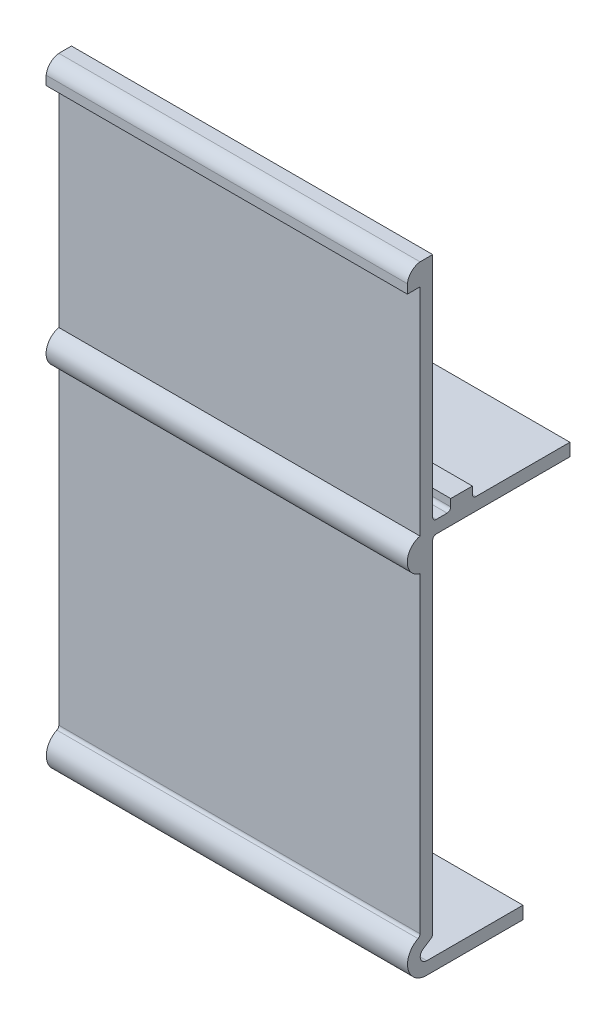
ISO-10303-21;
HEADER;
FILE_DESCRIPTION(('STEP AP214'),'2;1');
FILE_NAME('part.step','',(''),(''),'','','');
FILE_SCHEMA(('AUTOMOTIVE_DESIGN { 1 0 10303 214 1 1 1 1 }'));
ENDSEC;
DATA;
#1=APPLICATION_CONTEXT('core data for automotive mechanical design processes');
#2=APPLICATION_PROTOCOL_DEFINITION('international standard','automotive_design',2000,#1);
#3=PRODUCT_CONTEXT('',#1,'mechanical');
#4=PRODUCT('Part','Part','',(#3));
#5=PRODUCT_RELATED_PRODUCT_CATEGORY('part','',(#4));
#6=PRODUCT_DEFINITION_FORMATION('','',#4);
#7=PRODUCT_DEFINITION_CONTEXT('part definition',#1,'design');
#8=PRODUCT_DEFINITION('design','',#6,#7);
#9=PRODUCT_DEFINITION_SHAPE('','',#8);
#10=(LENGTH_UNIT() NAMED_UNIT(*) SI_UNIT(.MILLI.,.METRE.));
#11=(NAMED_UNIT(*) PLANE_ANGLE_UNIT() SI_UNIT($,.RADIAN.));
#12=(NAMED_UNIT(*) SI_UNIT($,.STERADIAN.) SOLID_ANGLE_UNIT());
#13=UNCERTAINTY_MEASURE_WITH_UNIT(LENGTH_MEASURE(1.E-05),#10,'distance_accuracy_value','');
#14=(GEOMETRIC_REPRESENTATION_CONTEXT(3) GLOBAL_UNCERTAINTY_ASSIGNED_CONTEXT((#13)) GLOBAL_UNIT_ASSIGNED_CONTEXT((#10,
#11,#12)) REPRESENTATION_CONTEXT('',''));
#15=CARTESIAN_POINT('',(0.,0.,0.));
#16=DIRECTION('',(0.,0.,1.));
#17=DIRECTION('',(1.,0.,0.));
#18=AXIS2_PLACEMENT_3D('',#15,#16,#17);
#19=CARTESIAN_POINT('',(-50.,104.500000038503,-39.6785715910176));
#20=DIRECTION('',(0.,0.,-1.));
#21=DIRECTION('',(-1.,0.,0.));
#22=AXIS2_PLACEMENT_3D('',#19,#20,#21);
#23=PLANE('',#22);
#24=DIRECTION('',(0.,1.,0.));
#25=VECTOR('',#24,1.);
#26=CARTESIAN_POINT('',(50.,104.500000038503,-39.6785715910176));
#27=LINE('',#26,#25);
#28=CARTESIAN_POINT('',(50.,104.500000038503,-39.6785715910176));
#29=VERTEX_POINT('',#28);
#30=CARTESIAN_POINT('',(50.,107.999999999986,-39.6785715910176));
#31=VERTEX_POINT('',#30);
#32=EDGE_CURVE('E251',#29,#31,#27,.T.);
#33=ORIENTED_EDGE('',*,*,#32,.F.);
#34=DIRECTION('',(1.,0.,0.));
#35=VECTOR('',#34,1.);
#36=CARTESIAN_POINT('',(-50.,104.500000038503,-39.6785715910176));
#37=LINE('',#36,#35);
#38=CARTESIAN_POINT('',(-50.,104.500000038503,-39.6785715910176));
#39=VERTEX_POINT('',#38);
#40=EDGE_CURVE('E11',#39,#29,#37,.T.);
#41=ORIENTED_EDGE('',*,*,#40,.F.);
#42=DIRECTION('',(0.,1.,0.));
#43=VECTOR('',#42,1.);
#44=CARTESIAN_POINT('',(-50.,104.500000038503,-39.6785715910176));
#45=LINE('',#44,#43);
#46=CARTESIAN_POINT('',(-50.,107.999999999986,-39.6785715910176));
#47=VERTEX_POINT('',#46);
#48=EDGE_CURVE('E331',#39,#47,#45,.T.);
#49=ORIENTED_EDGE('',*,*,#48,.T.);
#50=DIRECTION('',(1.,0.,0.));
#51=VECTOR('',#50,1.);
#52=CARTESIAN_POINT('',(-50.,107.999999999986,-39.6785715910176));
#53=LINE('',#52,#51);
#54=EDGE_CURVE('E37',#47,#31,#53,.T.);
#55=ORIENTED_EDGE('',*,*,#54,.T.);
#56=EDGE_LOOP('',(#33,#41,#49,#55));
#57=FACE_BOUND('',#56,.T.);
#58=ADVANCED_FACE('F34',(#57),#23,.T.);
#59=CARTESIAN_POINT('',(-50.,104.500000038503,-2.6785715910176));
#60=DIRECTION('',(0.,-1.,0.));
#61=DIRECTION('',(0.,0.,-1.));
#62=AXIS2_PLACEMENT_3D('',#59,#60,#61);
#63=PLANE('',#62);
#64=DIRECTION('',(0.,0.,-1.));
#65=VECTOR('',#64,1.);
#66=CARTESIAN_POINT('',(50.,104.500000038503,-2.6785715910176));
#67=LINE('',#66,#65);
#68=CARTESIAN_POINT('',(50.,104.500000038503,-2.6785715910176));
#69=VERTEX_POINT('',#68);
#70=EDGE_CURVE('E329',#69,#29,#67,.T.);
#71=ORIENTED_EDGE('',*,*,#70,.F.);
#72=DIRECTION('',(1.,0.,0.));
#73=VECTOR('',#72,1.);
#74=CARTESIAN_POINT('',(-50.,104.500000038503,-2.6785715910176));
#75=LINE('',#74,#73);
#76=CARTESIAN_POINT('',(-50.,104.500000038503,-2.6785715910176));
#77=VERTEX_POINT('',#76);
#78=EDGE_CURVE('E43',#77,#69,#75,.T.);
#79=ORIENTED_EDGE('',*,*,#78,.F.);
#80=DIRECTION('',(0.,0.,-1.));
#81=VECTOR('',#80,1.);
#82=CARTESIAN_POINT('',(-50.,104.500000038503,-2.6785715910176));
#83=LINE('',#82,#81);
#84=EDGE_CURVE('E241',#77,#39,#83,.T.);
#85=ORIENTED_EDGE('',*,*,#84,.T.);
#86=ORIENTED_EDGE('',*,*,#40,.T.);
#87=EDGE_LOOP('',(#71,#79,#85,#86));
#88=FACE_BOUND('',#87,.T.);
#89=ADVANCED_FACE('F383',(#88),#63,.T.);
#90=CARTESIAN_POINT('',(-50.,103.500000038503,-2.6785715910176));
#91=DIRECTION('',(1.,0.,0.));
#92=DIRECTION('',(0.,0.,-1.));
#93=AXIS2_PLACEMENT_3D('',#90,#91,#92);
#94=CYLINDRICAL_SURFACE('',#93,1.);
#95=CARTESIAN_POINT('',(50.,103.500000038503,-2.6785715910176));
#96=DIRECTION('',(-1.,0.,0.));
#97=DIRECTION('',(0.,0.,-1.));
#98=AXIS2_PLACEMENT_3D('',#95,#96,#97);
#99=CIRCLE('',#98,1.);
#100=CARTESIAN_POINT('',(50.,103.500000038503,-1.6785715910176));
#101=VERTEX_POINT('',#100);
#102=EDGE_CURVE('E228',#101,#69,#99,.T.);
#103=ORIENTED_EDGE('',*,*,#102,.F.);
#104=DIRECTION('',(1.,0.,0.));
#105=VECTOR('',#104,1.);
#106=CARTESIAN_POINT('',(-50.,103.500000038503,-1.6785715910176));
#107=LINE('',#106,#105);
#108=CARTESIAN_POINT('',(-50.,103.500000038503,-1.6785715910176));
#109=VERTEX_POINT('',#108);
#110=EDGE_CURVE('E223',#109,#101,#107,.T.);
#111=ORIENTED_EDGE('',*,*,#110,.F.);
#112=CARTESIAN_POINT('',(-50.,103.500000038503,-2.6785715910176));
#113=DIRECTION('',(-1.,0.,0.));
#114=DIRECTION('',(0.,0.,-1.));
#115=AXIS2_PLACEMENT_3D('',#112,#113,#114);
#116=CIRCLE('',#115,1.);
#117=EDGE_CURVE('E226',#109,#77,#116,.T.);
#118=ORIENTED_EDGE('',*,*,#117,.T.);
#119=ORIENTED_EDGE('',*,*,#78,.T.);
#120=EDGE_LOOP('',(#103,#111,#118,#119));
#121=FACE_BOUND('',#120,.T.);
#122=ADVANCED_FACE('F225',(#121),#94,.F.);
#123=CARTESIAN_POINT('',(-50.,103.500000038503,-1.6785715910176));
#124=DIRECTION('',(0.,0.,-1.));
#125=DIRECTION('',(-1.,0.,0.));
#126=AXIS2_PLACEMENT_3D('',#123,#124,#125);
#127=PLANE('',#126);
#128=DIRECTION('',(0.,1.,0.));
#129=VECTOR('',#128,1.);
#130=CARTESIAN_POINT('',(50.,103.500000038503,-1.6785715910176));
#131=LINE('',#130,#129);
#132=CARTESIAN_POINT('',(50.,9.07911749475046,-1.6785715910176));
#133=VERTEX_POINT('',#132);
#134=EDGE_CURVE('E326',#133,#101,#131,.T.);
#135=ORIENTED_EDGE('',*,*,#134,.F.);
#136=DIRECTION('',(1.,0.,0.));
#137=VECTOR('',#136,1.);
#138=CARTESIAN_POINT('',(-50.,9.07911749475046,-1.6785715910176));
#139=LINE('',#138,#137);
#140=CARTESIAN_POINT('',(-50.,9.07911749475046,-1.6785715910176));
#141=VERTEX_POINT('',#140);
#142=EDGE_CURVE('E233',#141,#133,#139,.T.);
#143=ORIENTED_EDGE('',*,*,#142,.F.);
#144=DIRECTION('',(0.,1.,0.));
#145=VECTOR('',#144,1.);
#146=CARTESIAN_POINT('',(-50.,103.500000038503,-1.6785715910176));
#147=LINE('',#146,#145);
#148=EDGE_CURVE('E239',#141,#109,#147,.T.);
#149=ORIENTED_EDGE('',*,*,#148,.T.);
#150=ORIENTED_EDGE('',*,*,#110,.T.);
#151=EDGE_LOOP('',(#135,#143,#149,#150));
#152=FACE_BOUND('',#151,.T.);
#153=ADVANCED_FACE('F243',(#152),#127,.T.);
#154=CARTESIAN_POINT('',(-50.,9.07911749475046,-0.67857159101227));
#155=DIRECTION('',(1.,0.,0.));
#156=DIRECTION('',(0.,0.,-1.));
#157=AXIS2_PLACEMENT_3D('',#154,#155,#156);
#158=CYLINDRICAL_SURFACE('',#157,1.00000000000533);
#159=CARTESIAN_POINT('',(50.,9.07911749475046,-0.67857159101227));
#160=DIRECTION('',(1.,0.,0.));
#161=DIRECTION('',(0.,0.,-1.));
#162=AXIS2_PLACEMENT_3D('',#159,#160,#161);
#163=CIRCLE('',#162,1.00000000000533);
#164=CARTESIAN_POINT('',(50.,8.23877684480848,-1.2206302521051));
#165=VERTEX_POINT('',#164);
#166=EDGE_CURVE('E323',#165,#133,#163,.T.);
#167=ORIENTED_EDGE('',*,*,#166,.F.);
#168=DIRECTION('',(1.,0.,0.));
#169=VECTOR('',#168,1.);
#170=CARTESIAN_POINT('',(-50.,8.23877684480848,-1.2206302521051));
#171=LINE('',#170,#169);
#172=CARTESIAN_POINT('',(-50.,8.23877684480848,-1.2206302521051));
#173=VERTEX_POINT('',#172);
#174=EDGE_CURVE('E335',#173,#165,#171,.T.);
#175=ORIENTED_EDGE('',*,*,#174,.F.);
#176=CARTESIAN_POINT('',(-50.,9.07911749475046,-0.67857159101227));
#177=DIRECTION('',(1.,0.,0.));
#178=DIRECTION('',(0.,0.,-1.));
#179=AXIS2_PLACEMENT_3D('',#176,#177,#178);
#180=CIRCLE('',#179,1.00000000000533);
#181=EDGE_CURVE('E244',#173,#141,#180,.T.);
#182=ORIENTED_EDGE('',*,*,#181,.T.);
#183=ORIENTED_EDGE('',*,*,#142,.T.);
#184=EDGE_LOOP('',(#167,#175,#182,#183));
#185=FACE_BOUND('',#184,.T.);
#186=ADVANCED_FACE('F396',(#185),#158,.T.);
#187=CARTESIAN_POINT('',(-50.,6.84942002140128,0.93325658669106));
#188=DIRECTION('',(0.,-0.840340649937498,-0.542058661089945));
#189=DIRECTION('',(0.,0.542058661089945,-0.840340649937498));
#190=AXIS2_PLACEMENT_3D('',#187,#188,#189);
#191=PLANE('',#190);
#192=DIRECTION('',(0.,0.542058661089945,-0.840340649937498));
#193=VECTOR('',#192,1.);
#194=CARTESIAN_POINT('',(50.,6.84942002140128,0.93325658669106));
#195=LINE('',#194,#193);
#196=CARTESIAN_POINT('',(50.,6.84942002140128,0.93325658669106));
#197=VERTEX_POINT('',#196);
#198=EDGE_CURVE('E320',#197,#165,#195,.T.);
#199=ORIENTED_EDGE('',*,*,#198,.F.);
#200=DIRECTION('',(1.,0.,0.));
#201=VECTOR('',#200,1.);
#202=CARTESIAN_POINT('',(-50.,6.84942002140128,0.93325658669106));
#203=LINE('',#202,#201);
#204=CARTESIAN_POINT('',(-50.,6.84942002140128,0.93325658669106));
#205=VERTEX_POINT('',#204);
#206=EDGE_CURVE('E337',#205,#197,#203,.T.);
#207=ORIENTED_EDGE('',*,*,#206,.F.);
#208=DIRECTION('',(0.,0.542058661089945,-0.840340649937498));
#209=VECTOR('',#208,1.);
#210=CARTESIAN_POINT('',(-50.,6.84942002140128,0.93325658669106));
#211=LINE('',#210,#209);
#212=EDGE_CURVE('E246',#205,#173,#211,.T.);
#213=ORIENTED_EDGE('',*,*,#212,.T.);
#214=ORIENTED_EDGE('',*,*,#174,.T.);
#215=EDGE_LOOP('',(#199,#207,#213,#214));
#216=FACE_BOUND('',#215,.T.);
#217=ADVANCED_FACE('F399',(#216),#191,.T.);
#218=CARTESIAN_POINT('',(-50.,5.32000003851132,-0.053290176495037));
#219=DIRECTION('',(1.,0.,0.));
#220=DIRECTION('',(0.,0.,-1.));
#221=AXIS2_PLACEMENT_3D('',#218,#219,#220);
#222=CYLINDRICAL_SURFACE('',#221,1.82000000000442);
#223=CARTESIAN_POINT('',(50.,5.32000003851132,-0.053290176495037));
#224=DIRECTION('',(-1.,0.,0.));
#225=DIRECTION('',(0.,0.,-1.));
#226=AXIS2_PLACEMENT_3D('',#223,#224,#225);
#227=CIRCLE('',#226,1.82000000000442);
#228=CARTESIAN_POINT('',(50.,3.5000000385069,-0.053290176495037));
#229=VERTEX_POINT('',#228);
#230=EDGE_CURVE('E317',#229,#197,#227,.T.);
#231=ORIENTED_EDGE('',*,*,#230,.F.);
#232=DIRECTION('',(1.,0.,0.));
#233=VECTOR('',#232,1.);
#234=CARTESIAN_POINT('',(-50.,3.5000000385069,-0.053290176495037));
#235=LINE('',#234,#233);
#236=CARTESIAN_POINT('',(-50.,3.5000000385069,-0.053290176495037));
#237=VERTEX_POINT('',#236);
#238=EDGE_CURVE('E339',#237,#229,#235,.T.);
#239=ORIENTED_EDGE('',*,*,#238,.F.);
#240=CARTESIAN_POINT('',(-50.,5.32000003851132,-0.053290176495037));
#241=DIRECTION('',(-1.,0.,0.));
#242=DIRECTION('',(0.,0.,-1.));
#243=AXIS2_PLACEMENT_3D('',#240,#241,#242);
#244=CIRCLE('',#243,1.82000000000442);
#245=EDGE_CURVE('E744',#237,#205,#244,.T.);
#246=ORIENTED_EDGE('',*,*,#245,.T.);
#247=ORIENTED_EDGE('',*,*,#206,.T.);
#248=EDGE_LOOP('',(#231,#239,#246,#247));
#249=FACE_BOUND('',#248,.T.);
#250=ADVANCED_FACE('F403',(#249),#222,.F.);
#251=CARTESIAN_POINT('',(-50.,3.5000000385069,-26.6785715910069));
#252=DIRECTION('',(0.,1.,0.));
#253=DIRECTION('',(0.,0.,1.));
#254=AXIS2_PLACEMENT_3D('',#251,#252,#253);
#255=PLANE('',#254);
#256=DIRECTION('',(0.,0.,1.));
#257=VECTOR('',#256,1.);
#258=CARTESIAN_POINT('',(50.,3.5000000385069,-26.6785715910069));
#259=LINE('',#258,#257);
#260=CARTESIAN_POINT('',(50.,3.5000000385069,-26.6785715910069));
#261=VERTEX_POINT('',#260);
#262=EDGE_CURVE('E314',#261,#229,#259,.T.);
#263=ORIENTED_EDGE('',*,*,#262,.F.);
#264=DIRECTION('',(1.,0.,0.));
#265=VECTOR('',#264,1.);
#266=CARTESIAN_POINT('',(-50.,3.5000000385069,-26.6785715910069));
#267=LINE('',#266,#265);
#268=CARTESIAN_POINT('',(-50.,3.5000000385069,-26.6785715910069));
#269=VERTEX_POINT('',#268);
#270=EDGE_CURVE('E341',#269,#261,#267,.T.);
#271=ORIENTED_EDGE('',*,*,#270,.F.);
#272=DIRECTION('',(0.,0.,1.));
#273=VECTOR('',#272,1.);
#274=CARTESIAN_POINT('',(-50.,3.5000000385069,-26.6785715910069));
#275=LINE('',#274,#273);
#276=EDGE_CURVE('E740',#269,#237,#275,.T.);
#277=ORIENTED_EDGE('',*,*,#276,.T.);
#278=ORIENTED_EDGE('',*,*,#238,.T.);
#279=EDGE_LOOP('',(#263,#271,#277,#278));
#280=FACE_BOUND('',#279,.T.);
#281=ADVANCED_FACE('F407',(#280),#255,.T.);
#282=CARTESIAN_POINT('',(-50.,3.85068392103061E-08,-26.6785715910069));
#283=DIRECTION('',(0.,0.,-1.));
#284=DIRECTION('',(-1.,0.,0.));
#285=AXIS2_PLACEMENT_3D('',#282,#283,#284);
#286=PLANE('',#285);
#287=DIRECTION('',(0.,1.,0.));
#288=VECTOR('',#287,1.);
#289=CARTESIAN_POINT('',(50.,3.85068392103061E-08,-26.6785715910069));
#290=LINE('',#289,#288);
#291=CARTESIAN_POINT('',(50.,3.85068392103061E-08,-26.6785715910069));
#292=VERTEX_POINT('',#291);
#293=EDGE_CURVE('E311',#292,#261,#290,.T.);
#294=ORIENTED_EDGE('',*,*,#293,.F.);
#295=DIRECTION('',(1.,0.,0.));
#296=VECTOR('',#295,1.);
#297=CARTESIAN_POINT('',(-50.,3.85068392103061E-08,-26.6785715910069));
#298=LINE('',#297,#296);
#299=CARTESIAN_POINT('',(-50.,3.85068392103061E-08,-26.6785715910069));
#300=VERTEX_POINT('',#299);
#301=EDGE_CURVE('E343',#300,#292,#298,.T.);
#302=ORIENTED_EDGE('',*,*,#301,.F.);
#303=DIRECTION('',(0.,1.,0.));
#304=VECTOR('',#303,1.);
#305=CARTESIAN_POINT('',(-50.,3.85068392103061E-08,-26.6785715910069));
#306=LINE('',#305,#304);
#307=EDGE_CURVE('E751',#300,#269,#306,.T.);
#308=ORIENTED_EDGE('',*,*,#307,.T.);
#309=ORIENTED_EDGE('',*,*,#270,.T.);
#310=EDGE_LOOP('',(#294,#302,#308,#309));
#311=FACE_BOUND('',#310,.T.);
#312=ADVANCED_FACE('F411',(#311),#286,.T.);
#313=CARTESIAN_POINT('',(-50.,3.85068392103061E-08,-1.62397996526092E-07));
#314=DIRECTION('',(0.,-1.,0.));
#315=DIRECTION('',(0.,0.,-1.));
#316=AXIS2_PLACEMENT_3D('',#313,#314,#315);
#317=PLANE('',#316);
#318=DIRECTION('',(0.,0.,-1.));
#319=VECTOR('',#318,1.);
#320=CARTESIAN_POINT('',(50.,3.85068392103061E-08,-1.62397996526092E-07));
#321=LINE('',#320,#319);
#322=CARTESIAN_POINT('',(50.,3.85066856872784E-08,-1.62397995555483E-07));
#323=VERTEX_POINT('',#322);
#324=EDGE_CURVE('E308',#323,#292,#321,.T.);
#325=ORIENTED_EDGE('',*,*,#324,.F.);
#326=DIRECTION('',(1.,0.,0.));
#327=VECTOR('',#326,1.);
#328=CARTESIAN_POINT('',(-50.,3.85066856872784E-08,-1.62397995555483E-07));
#329=LINE('',#328,#327);
#330=CARTESIAN_POINT('',(-50.,3.85066856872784E-08,-1.62397995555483E-07));
#331=VERTEX_POINT('',#330);
#332=EDGE_CURVE('E345',#331,#323,#329,.T.);
#333=ORIENTED_EDGE('',*,*,#332,.F.);
#334=DIRECTION('',(0.,0.,-1.));
#335=VECTOR('',#334,1.);
#336=CARTESIAN_POINT('',(-50.,3.85068392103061E-08,-1.62397996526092E-07));
#337=LINE('',#336,#335);
#338=EDGE_CURVE('E733',#331,#300,#337,.T.);
#339=ORIENTED_EDGE('',*,*,#338,.T.);
#340=ORIENTED_EDGE('',*,*,#301,.T.);
#341=EDGE_LOOP('',(#325,#333,#339,#340));
#342=FACE_BOUND('',#341,.T.);
#343=ADVANCED_FACE('F415',(#342),#317,.T.);
#344=CARTESIAN_POINT('',(-50.,5.28392515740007,-1.62397996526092E-07));
#345=DIRECTION('',(1.,0.,0.));
#346=DIRECTION('',(0.,0.,-1.));
#347=AXIS2_PLACEMENT_3D('',#344,#345,#346);
#348=CYLINDRICAL_SURFACE('',#347,5.28392511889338);
#349=CARTESIAN_POINT('',(50.,5.28392515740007,-1.62397996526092E-07));
#350=DIRECTION('',(1.,0.,0.));
#351=DIRECTION('',(0.,0.,-1.));
#352=AXIS2_PLACEMENT_3D('',#349,#350,#351);
#353=CIRCLE('',#352,5.28392511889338);
#354=CARTESIAN_POINT('',(50.,10.0053027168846,2.37243710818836));
#355=VERTEX_POINT('',#354);
#356=EDGE_CURVE('E305',#355,#323,#353,.T.);
#357=ORIENTED_EDGE('',*,*,#356,.F.);
#358=DIRECTION('',(1.,0.,0.));
#359=VECTOR('',#358,1.);
#360=CARTESIAN_POINT('',(-50.,10.0053027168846,2.37243710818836));
#361=LINE('',#360,#359);
#362=CARTESIAN_POINT('',(-50.,10.0053027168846,2.37243710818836));
#363=VERTEX_POINT('',#362);
#364=EDGE_CURVE('E347',#363,#355,#361,.T.);
#365=ORIENTED_EDGE('',*,*,#364,.F.);
#366=CARTESIAN_POINT('',(-50.,5.28392515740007,-1.62397996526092E-07));
#367=DIRECTION('',(1.,0.,0.));
#368=DIRECTION('',(0.,0.,-1.));
#369=AXIS2_PLACEMENT_3D('',#366,#367,#368);
#370=CIRCLE('',#369,5.28392511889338);
#371=EDGE_CURVE('E729',#363,#331,#370,.T.);
#372=ORIENTED_EDGE('',*,*,#371,.T.);
#373=ORIENTED_EDGE('',*,*,#332,.T.);
#374=EDGE_LOOP('',(#357,#365,#372,#373));
#375=FACE_BOUND('',#374,.T.);
#376=ADVANCED_FACE('F419',(#375),#348,.T.);
#377=CARTESIAN_POINT('',(-50.,10.8988387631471,2.82142857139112));
#378=DIRECTION('',(1.,0.,0.));
#379=DIRECTION('',(0.,0.,-1.));
#380=AXIS2_PLACEMENT_3D('',#377,#378,#379);
#381=CYLINDRICAL_SURFACE('',#380,0.999999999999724);
#382=CARTESIAN_POINT('',(50.,10.8988387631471,2.82142857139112));
#383=DIRECTION('',(-1.,0.,0.));
#384=DIRECTION('',(0.,0.,-1.));
#385=AXIS2_PLACEMENT_3D('',#382,#383,#384);
#386=CIRCLE('',#385,0.999999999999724);
#387=CARTESIAN_POINT('',(50.,10.8988387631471,1.82142857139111));
#388=VERTEX_POINT('',#387);
#389=EDGE_CURVE('E302',#388,#355,#386,.T.);
#390=ORIENTED_EDGE('',*,*,#389,.F.);
#391=DIRECTION('',(1.,0.,0.));
#392=VECTOR('',#391,1.);
#393=CARTESIAN_POINT('',(-50.,10.8988387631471,1.82142857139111));
#394=LINE('',#393,#392);
#395=CARTESIAN_POINT('',(-50.,10.8988387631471,1.82142857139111));
#396=VERTEX_POINT('',#395);
#397=EDGE_CURVE('E349',#396,#388,#394,.T.);
#398=ORIENTED_EDGE('',*,*,#397,.F.);
#399=CARTESIAN_POINT('',(-50.,10.8988387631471,2.82142857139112));
#400=DIRECTION('',(-1.,0.,0.));
#401=DIRECTION('',(0.,0.,-1.));
#402=AXIS2_PLACEMENT_3D('',#399,#400,#401);
#403=CIRCLE('',#402,0.999999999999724);
#404=EDGE_CURVE('E755',#396,#363,#403,.T.);
#405=ORIENTED_EDGE('',*,*,#404,.T.);
#406=ORIENTED_EDGE('',*,*,#364,.T.);
#407=EDGE_LOOP('',(#390,#398,#405,#406));
#408=FACE_BOUND('',#407,.T.);
#409=ADVANCED_FACE('F423',(#408),#381,.F.);
#410=CARTESIAN_POINT('',(-50.,97.2500000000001,1.82142857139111));
#411=DIRECTION('',(0.,0.,1.));
#412=DIRECTION('',(1.,0.,0.));
#413=AXIS2_PLACEMENT_3D('',#410,#411,#412);
#414=PLANE('',#413);
#415=DIRECTION('',(0.,-1.,0.));
#416=VECTOR('',#415,1.);
#417=CARTESIAN_POINT('',(50.,97.2500000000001,1.82142857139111));
#418=LINE('',#417,#416);
#419=CARTESIAN_POINT('',(50.,97.25,1.82142857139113));
#420=VERTEX_POINT('',#419);
#421=EDGE_CURVE('E299',#420,#388,#418,.T.);
#422=ORIENTED_EDGE('',*,*,#421,.F.);
#423=DIRECTION('',(1.,0.,0.));
#424=VECTOR('',#423,1.);
#425=CARTESIAN_POINT('',(-50.,97.25,1.82142857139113));
#426=LINE('',#425,#424);
#427=CARTESIAN_POINT('',(-50.,97.25,1.82142857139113));
#428=VERTEX_POINT('',#427);
#429=EDGE_CURVE('E351',#428,#420,#426,.T.);
#430=ORIENTED_EDGE('',*,*,#429,.F.);
#431=DIRECTION('',(0.,-1.,0.));
#432=VECTOR('',#431,1.);
#433=CARTESIAN_POINT('',(-50.,97.2500000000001,1.82142857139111));
#434=LINE('',#433,#432);
#435=EDGE_CURVE('E722',#428,#396,#434,.T.);
#436=ORIENTED_EDGE('',*,*,#435,.T.);
#437=ORIENTED_EDGE('',*,*,#397,.T.);
#438=EDGE_LOOP('',(#422,#430,#436,#437));
#439=FACE_BOUND('',#438,.T.);
#440=ADVANCED_FACE('F427',(#439),#414,.T.);
#441=CARTESIAN_POINT('',(-50.,101.75,0.716355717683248));
#442=DIRECTION('',(1.,0.,0.));
#443=DIRECTION('',(0.,0.,-1.));
#444=AXIS2_PLACEMENT_3D('',#441,#442,#443);
#445=CYLINDRICAL_SURFACE('',#444,4.63370111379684);
#446=CARTESIAN_POINT('',(50.,101.75,0.716355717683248));
#447=DIRECTION('',(1.,0.,0.));
#448=DIRECTION('',(0.,0.,-1.));
#449=AXIS2_PLACEMENT_3D('',#446,#447,#448);
#450=CIRCLE('',#449,4.63370111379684);
#451=CARTESIAN_POINT('',(50.,106.25,1.82142857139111));
#452=VERTEX_POINT('',#451);
#453=EDGE_CURVE('E296',#452,#420,#450,.T.);
#454=ORIENTED_EDGE('',*,*,#453,.F.);
#455=DIRECTION('',(1.,0.,0.));
#456=VECTOR('',#455,1.);
#457=CARTESIAN_POINT('',(-50.,106.25,1.82142857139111));
#458=LINE('',#457,#456);
#459=CARTESIAN_POINT('',(-50.,106.25,1.82142857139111));
#460=VERTEX_POINT('',#459);
#461=EDGE_CURVE('E353',#460,#452,#458,.T.);
#462=ORIENTED_EDGE('',*,*,#461,.F.);
#463=CARTESIAN_POINT('',(-50.,101.75,0.716355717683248));
#464=DIRECTION('',(1.,0.,0.));
#465=DIRECTION('',(0.,0.,-1.));
#466=AXIS2_PLACEMENT_3D('',#463,#464,#465);
#467=CIRCLE('',#466,4.63370111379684);
#468=EDGE_CURVE('E718',#460,#428,#467,.T.);
#469=ORIENTED_EDGE('',*,*,#468,.T.);
#470=ORIENTED_EDGE('',*,*,#429,.T.);
#471=EDGE_LOOP('',(#454,#462,#469,#470));
#472=FACE_BOUND('',#471,.T.);
#473=ADVANCED_FACE('F431',(#472),#445,.T.);
#474=CARTESIAN_POINT('',(-50.,166.,1.82142857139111));
#475=DIRECTION('',(0.,0.,1.));
#476=DIRECTION('',(1.,0.,0.));
#477=AXIS2_PLACEMENT_3D('',#474,#475,#476);
#478=PLANE('',#477);
#479=DIRECTION('',(0.,-1.,0.));
#480=VECTOR('',#479,1.);
#481=CARTESIAN_POINT('',(50.,166.,1.82142857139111));
#482=LINE('',#481,#480);
#483=CARTESIAN_POINT('',(50.,166.,1.82142857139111));
#484=VERTEX_POINT('',#483);
#485=EDGE_CURVE('E293',#484,#452,#482,.T.);
#486=ORIENTED_EDGE('',*,*,#485,.F.);
#487=DIRECTION('',(1.,0.,0.));
#488=VECTOR('',#487,1.);
#489=CARTESIAN_POINT('',(-50.,166.,1.82142857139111));
#490=LINE('',#489,#488);
#491=CARTESIAN_POINT('',(-50.,166.,1.82142857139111));
#492=VERTEX_POINT('',#491);
#493=EDGE_CURVE('E355',#492,#484,#490,.T.);
#494=ORIENTED_EDGE('',*,*,#493,.F.);
#495=DIRECTION('',(0.,-1.,0.));
#496=VECTOR('',#495,1.);
#497=CARTESIAN_POINT('',(-50.,166.,1.82142857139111));
#498=LINE('',#497,#496);
#499=EDGE_CURVE('E759',#492,#460,#498,.T.);
#500=ORIENTED_EDGE('',*,*,#499,.T.);
#501=ORIENTED_EDGE('',*,*,#461,.T.);
#502=EDGE_LOOP('',(#486,#494,#500,#501));
#503=FACE_BOUND('',#502,.T.);
#504=ADVANCED_FACE('F435',(#503),#478,.T.);
#505=CARTESIAN_POINT('',(-50.,166.,5.32142857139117));
#506=DIRECTION('',(0.,-1.,0.));
#507=DIRECTION('',(0.,0.,-1.));
#508=AXIS2_PLACEMENT_3D('',#505,#506,#507);
#509=PLANE('',#508);
#510=DIRECTION('',(0.,0.,-1.));
#511=VECTOR('',#510,1.);
#512=CARTESIAN_POINT('',(50.,166.,5.32142857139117));
#513=LINE('',#512,#511);
#514=CARTESIAN_POINT('',(50.,166.,5.32142857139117));
#515=VERTEX_POINT('',#514);
#516=EDGE_CURVE('E290',#515,#484,#513,.T.);
#517=ORIENTED_EDGE('',*,*,#516,.F.);
#518=DIRECTION('',(1.,0.,0.));
#519=VECTOR('',#518,1.);
#520=CARTESIAN_POINT('',(-50.,166.,5.32142857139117));
#521=LINE('',#520,#519);
#522=CARTESIAN_POINT('',(-50.,166.,5.32142857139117));
#523=VERTEX_POINT('',#522);
#524=EDGE_CURVE('E357',#523,#515,#521,.T.);
#525=ORIENTED_EDGE('',*,*,#524,.F.);
#526=DIRECTION('',(0.,0.,-1.));
#527=VECTOR('',#526,1.);
#528=CARTESIAN_POINT('',(-50.,166.,5.32142857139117));
#529=LINE('',#528,#527);
#530=EDGE_CURVE('E711',#523,#492,#529,.T.);
#531=ORIENTED_EDGE('',*,*,#530,.T.);
#532=ORIENTED_EDGE('',*,*,#493,.T.);
#533=EDGE_LOOP('',(#517,#525,#531,#532));
#534=FACE_BOUND('',#533,.T.);
#535=ADVANCED_FACE('F439',(#534),#509,.T.);
#536=CARTESIAN_POINT('',(-50.,168.5,5.32142857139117));
#537=DIRECTION('',(0.,0.,1.));
#538=DIRECTION('',(1.,0.,0.));
#539=AXIS2_PLACEMENT_3D('',#536,#537,#538);
#540=PLANE('',#539);
#541=DIRECTION('',(0.,-1.,0.));
#542=VECTOR('',#541,1.);
#543=CARTESIAN_POINT('',(50.,168.5,5.32142857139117));
#544=LINE('',#543,#542);
#545=CARTESIAN_POINT('',(50.,168.5,5.32142857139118));
#546=VERTEX_POINT('',#545);
#547=EDGE_CURVE('E287',#546,#515,#544,.T.);
#548=ORIENTED_EDGE('',*,*,#547,.F.);
#549=DIRECTION('',(1.,0.,0.));
#550=VECTOR('',#549,1.);
#551=CARTESIAN_POINT('',(-50.,168.5,5.32142857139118));
#552=LINE('',#551,#550);
#553=CARTESIAN_POINT('',(-50.,168.5,5.32142857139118));
#554=VERTEX_POINT('',#553);
#555=EDGE_CURVE('E359',#554,#546,#552,.T.);
#556=ORIENTED_EDGE('',*,*,#555,.F.);
#557=DIRECTION('',(0.,-1.,0.));
#558=VECTOR('',#557,1.);
#559=CARTESIAN_POINT('',(-50.,168.5,5.32142857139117));
#560=LINE('',#559,#558);
#561=EDGE_CURVE('E707',#554,#523,#560,.T.);
#562=ORIENTED_EDGE('',*,*,#561,.T.);
#563=ORIENTED_EDGE('',*,*,#524,.T.);
#564=EDGE_LOOP('',(#548,#556,#562,#563));
#565=FACE_BOUND('',#564,.T.);
#566=ADVANCED_FACE('F443',(#565),#540,.T.);
#567=CARTESIAN_POINT('',(-50.,168.027950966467,1.34937953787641));
#568=DIRECTION('',(1.,0.,0.));
#569=DIRECTION('',(0.,0.,-1.));
#570=AXIS2_PLACEMENT_3D('',#567,#568,#569);
#571=CYLINDRICAL_SURFACE('',#570,4.00000047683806);
#572=CARTESIAN_POINT('',(50.,168.027950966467,1.34937953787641));
#573=DIRECTION('',(1.,0.,0.));
#574=DIRECTION('',(0.,0.,-1.));
#575=AXIS2_PLACEMENT_3D('',#572,#573,#574);
#576=CIRCLE('',#575,4.00000047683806);
#577=CARTESIAN_POINT('',(50.,171.999999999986,1.82142857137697));
#578=VERTEX_POINT('',#577);
#579=EDGE_CURVE('E284',#578,#546,#576,.T.);
#580=ORIENTED_EDGE('',*,*,#579,.F.);
#581=DIRECTION('',(1.,0.,0.));
#582=VECTOR('',#581,1.);
#583=CARTESIAN_POINT('',(-50.,171.999999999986,1.82142857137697));
#584=LINE('',#583,#582);
#585=CARTESIAN_POINT('',(-50.,171.999999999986,1.82142857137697));
#586=VERTEX_POINT('',#585);
#587=EDGE_CURVE('E361',#586,#578,#584,.T.);
#588=ORIENTED_EDGE('',*,*,#587,.F.);
#589=CARTESIAN_POINT('',(-50.,168.027950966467,1.34937953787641));
#590=DIRECTION('',(1.,0.,0.));
#591=DIRECTION('',(0.,0.,-1.));
#592=AXIS2_PLACEMENT_3D('',#589,#590,#591);
#593=CIRCLE('',#592,4.00000047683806);
#594=EDGE_CURVE('E763',#586,#554,#593,.T.);
#595=ORIENTED_EDGE('',*,*,#594,.T.);
#596=ORIENTED_EDGE('',*,*,#555,.T.);
#597=EDGE_LOOP('',(#580,#588,#595,#596));
#598=FACE_BOUND('',#597,.T.);
#599=ADVANCED_FACE('F447',(#598),#571,.T.);
#600=CARTESIAN_POINT('',(-50.,171.999999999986,-1.67857142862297));
#601=DIRECTION('',(0.,1.,0.));
#602=DIRECTION('',(0.,0.,1.));
#603=AXIS2_PLACEMENT_3D('',#600,#601,#602);
#604=PLANE('',#603);
#605=DIRECTION('',(0.,0.,1.));
#606=VECTOR('',#605,1.);
#607=CARTESIAN_POINT('',(50.,171.999999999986,-1.67857142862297));
#608=LINE('',#607,#606);
#609=CARTESIAN_POINT('',(50.,171.999999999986,-1.67857142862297));
#610=VERTEX_POINT('',#609);
#611=EDGE_CURVE('E281',#610,#578,#608,.T.);
#612=ORIENTED_EDGE('',*,*,#611,.F.);
#613=DIRECTION('',(1.,0.,0.));
#614=VECTOR('',#613,1.);
#615=CARTESIAN_POINT('',(-50.,171.999999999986,-1.67857142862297));
#616=LINE('',#615,#614);
#617=CARTESIAN_POINT('',(-50.,171.999999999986,-1.67857142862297));
#618=VERTEX_POINT('',#617);
#619=EDGE_CURVE('E363',#618,#610,#616,.T.);
#620=ORIENTED_EDGE('',*,*,#619,.F.);
#621=DIRECTION('',(0.,0.,1.));
#622=VECTOR('',#621,1.);
#623=CARTESIAN_POINT('',(-50.,171.999999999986,-1.67857142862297));
#624=LINE('',#623,#622);
#625=EDGE_CURVE('E700',#618,#586,#624,.T.);
#626=ORIENTED_EDGE('',*,*,#625,.T.);
#627=ORIENTED_EDGE('',*,*,#587,.T.);
#628=EDGE_LOOP('',(#612,#620,#626,#627));
#629=FACE_BOUND('',#628,.T.);
#630=ADVANCED_FACE('F451',(#629),#604,.T.);
#631=CARTESIAN_POINT('',(-50.,108.999999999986,-1.67857142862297));
#632=DIRECTION('',(0.,0.,-1.));
#633=DIRECTION('',(-1.,0.,0.));
#634=AXIS2_PLACEMENT_3D('',#631,#632,#633);
#635=PLANE('',#634);
#636=DIRECTION('',(0.,1.,0.));
#637=VECTOR('',#636,1.);
#638=CARTESIAN_POINT('',(50.,108.999999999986,-1.67857142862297));
#639=LINE('',#638,#637);
#640=CARTESIAN_POINT('',(50.,108.999999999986,-1.67857142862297));
#641=VERTEX_POINT('',#640);
#642=EDGE_CURVE('E278',#641,#610,#639,.T.);
#643=ORIENTED_EDGE('',*,*,#642,.F.);
#644=DIRECTION('',(1.,0.,0.));
#645=VECTOR('',#644,1.);
#646=CARTESIAN_POINT('',(-50.,108.999999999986,-1.67857142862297));
#647=LINE('',#646,#645);
#648=CARTESIAN_POINT('',(-50.,108.999999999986,-1.67857142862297));
#649=VERTEX_POINT('',#648);
#650=EDGE_CURVE('E365',#649,#641,#647,.T.);
#651=ORIENTED_EDGE('',*,*,#650,.F.);
#652=DIRECTION('',(0.,1.,0.));
#653=VECTOR('',#652,1.);
#654=CARTESIAN_POINT('',(-50.,108.999999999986,-1.67857142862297));
#655=LINE('',#654,#653);
#656=EDGE_CURVE('E696',#649,#618,#655,.T.);
#657=ORIENTED_EDGE('',*,*,#656,.T.);
#658=ORIENTED_EDGE('',*,*,#619,.T.);
#659=EDGE_LOOP('',(#643,#651,#657,#658));
#660=FACE_BOUND('',#659,.T.);
#661=ADVANCED_FACE('F455',(#660),#635,.T.);
#662=CARTESIAN_POINT('',(-50.,108.999999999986,-2.67857142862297));
#663=DIRECTION('',(1.,0.,0.));
#664=DIRECTION('',(0.,0.,-1.));
#665=AXIS2_PLACEMENT_3D('',#662,#663,#664);
#666=CYLINDRICAL_SURFACE('',#665,1.);
#667=CARTESIAN_POINT('',(50.,108.999999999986,-2.67857142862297));
#668=DIRECTION('',(-1.,0.,0.));
#669=DIRECTION('',(0.,0.,-1.));
#670=AXIS2_PLACEMENT_3D('',#667,#668,#669);
#671=CIRCLE('',#670,1.);
#672=CARTESIAN_POINT('',(50.,107.999999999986,-2.67857142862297));
#673=VERTEX_POINT('',#672);
#674=EDGE_CURVE('E275',#673,#641,#671,.T.);
#675=ORIENTED_EDGE('',*,*,#674,.F.);
#676=DIRECTION('',(1.,0.,0.));
#677=VECTOR('',#676,1.);
#678=CARTESIAN_POINT('',(-50.,107.999999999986,-2.67857142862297));
#679=LINE('',#678,#677);
#680=CARTESIAN_POINT('',(-50.,107.999999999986,-2.67857142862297));
#681=VERTEX_POINT('',#680);
#682=EDGE_CURVE('E367',#681,#673,#679,.T.);
#683=ORIENTED_EDGE('',*,*,#682,.F.);
#684=CARTESIAN_POINT('',(-50.,108.999999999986,-2.67857142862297));
#685=DIRECTION('',(-1.,0.,0.));
#686=DIRECTION('',(0.,0.,-1.));
#687=AXIS2_PLACEMENT_3D('',#684,#685,#686);
#688=CIRCLE('',#687,1.);
#689=EDGE_CURVE('E767',#681,#649,#688,.T.);
#690=ORIENTED_EDGE('',*,*,#689,.T.);
#691=ORIENTED_EDGE('',*,*,#650,.T.);
#692=EDGE_LOOP('',(#675,#683,#690,#691));
#693=FACE_BOUND('',#692,.T.);
#694=ADVANCED_FACE('F459',(#693),#666,.F.);
#695=CARTESIAN_POINT('',(-50.,107.999999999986,-5.67857142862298));
#696=DIRECTION('',(0.,1.,0.));
#697=DIRECTION('',(0.,0.,1.));
#698=AXIS2_PLACEMENT_3D('',#695,#696,#697);
#699=PLANE('',#698);
#700=DIRECTION('',(0.,0.,1.));
#701=VECTOR('',#700,1.);
#702=CARTESIAN_POINT('',(50.,107.999999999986,-5.67857142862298));
#703=LINE('',#702,#701);
#704=CARTESIAN_POINT('',(50.,107.999999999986,-5.67857142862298));
#705=VERTEX_POINT('',#704);
#706=EDGE_CURVE('E272',#705,#673,#703,.T.);
#707=ORIENTED_EDGE('',*,*,#706,.F.);
#708=DIRECTION('',(1.,0.,0.));
#709=VECTOR('',#708,1.);
#710=CARTESIAN_POINT('',(-50.,107.999999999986,-5.67857142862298));
#711=LINE('',#710,#709);
#712=CARTESIAN_POINT('',(-50.,107.999999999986,-5.67857142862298));
#713=VERTEX_POINT('',#712);
#714=EDGE_CURVE('E369',#713,#705,#711,.T.);
#715=ORIENTED_EDGE('',*,*,#714,.F.);
#716=DIRECTION('',(0.,0.,1.));
#717=VECTOR('',#716,1.);
#718=CARTESIAN_POINT('',(-50.,107.999999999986,-5.67857142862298));
#719=LINE('',#718,#717);
#720=EDGE_CURVE('E689',#713,#681,#719,.T.);
#721=ORIENTED_EDGE('',*,*,#720,.T.);
#722=ORIENTED_EDGE('',*,*,#682,.T.);
#723=EDGE_LOOP('',(#707,#715,#721,#722));
#724=FACE_BOUND('',#723,.T.);
#725=ADVANCED_FACE('F463',(#724),#699,.T.);
#726=CARTESIAN_POINT('',(-50.,108.999999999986,-5.67857142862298));
#727=DIRECTION('',(1.,0.,0.));
#728=DIRECTION('',(0.,0.,-1.));
#729=AXIS2_PLACEMENT_3D('',#726,#727,#728);
#730=CYLINDRICAL_SURFACE('',#729,1.);
#731=CARTESIAN_POINT('',(50.,108.999999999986,-5.67857142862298));
#732=DIRECTION('',(-1.,0.,0.));
#733=DIRECTION('',(0.,0.,-1.));
#734=AXIS2_PLACEMENT_3D('',#731,#732,#733);
#735=CIRCLE('',#734,1.);
#736=CARTESIAN_POINT('',(50.,108.999999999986,-6.67857142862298));
#737=VERTEX_POINT('',#736);
#738=EDGE_CURVE('E269',#737,#705,#735,.T.);
#739=ORIENTED_EDGE('',*,*,#738,.F.);
#740=DIRECTION('',(1.,0.,0.));
#741=VECTOR('',#740,1.);
#742=CARTESIAN_POINT('',(-50.,108.999999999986,-6.67857142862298));
#743=LINE('',#742,#741);
#744=CARTESIAN_POINT('',(-50.,108.999999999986,-6.67857142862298));
#745=VERTEX_POINT('',#744);
#746=EDGE_CURVE('E371',#745,#737,#743,.T.);
#747=ORIENTED_EDGE('',*,*,#746,.F.);
#748=CARTESIAN_POINT('',(-50.,108.999999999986,-5.67857142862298));
#749=DIRECTION('',(-1.,0.,0.));
#750=DIRECTION('',(0.,0.,-1.));
#751=AXIS2_PLACEMENT_3D('',#748,#749,#750);
#752=CIRCLE('',#751,1.);
#753=EDGE_CURVE('E685',#745,#713,#752,.T.);
#754=ORIENTED_EDGE('',*,*,#753,.T.);
#755=ORIENTED_EDGE('',*,*,#714,.T.);
#756=EDGE_LOOP('',(#739,#747,#754,#755));
#757=FACE_BOUND('',#756,.T.);
#758=ADVANCED_FACE('F467',(#757),#730,.F.);
#759=CARTESIAN_POINT('',(-50.,108.999999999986,-6.67857142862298));
#760=DIRECTION('',(0.,0.,1.));
#761=DIRECTION('',(1.,0.,0.));
#762=AXIS2_PLACEMENT_3D('',#759,#760,#761);
#763=PLANE('',#762);
#764=DIRECTION('',(0.,-1.,0.));
#765=VECTOR('',#764,1.);
#766=CARTESIAN_POINT('',(50.,108.999999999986,-6.67857142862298));
#767=LINE('',#766,#765);
#768=CARTESIAN_POINT('',(50.,110.999999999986,-6.67857142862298));
#769=VERTEX_POINT('',#768);
#770=EDGE_CURVE('E266',#769,#737,#767,.T.);
#771=ORIENTED_EDGE('',*,*,#770,.F.);
#772=DIRECTION('',(1.,0.,0.));
#773=VECTOR('',#772,1.);
#774=CARTESIAN_POINT('',(-50.,110.999999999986,-6.67857142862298));
#775=LINE('',#774,#773);
#776=CARTESIAN_POINT('',(-50.,110.999999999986,-6.67857142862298));
#777=VERTEX_POINT('',#776);
#778=EDGE_CURVE('E373',#777,#769,#775,.T.);
#779=ORIENTED_EDGE('',*,*,#778,.F.);
#780=DIRECTION('',(0.,-1.,0.));
#781=VECTOR('',#780,1.);
#782=CARTESIAN_POINT('',(-50.,108.999999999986,-6.67857142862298));
#783=LINE('',#782,#781);
#784=EDGE_CURVE('E771',#777,#745,#783,.T.);
#785=ORIENTED_EDGE('',*,*,#784,.T.);
#786=ORIENTED_EDGE('',*,*,#746,.T.);
#787=EDGE_LOOP('',(#771,#779,#785,#786));
#788=FACE_BOUND('',#787,.T.);
#789=ADVANCED_FACE('F471',(#788),#763,.T.);
#790=CARTESIAN_POINT('',(-50.,110.999999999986,-6.67857142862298));
#791=DIRECTION('',(0.,1.,0.));
#792=DIRECTION('',(0.,0.,1.));
#793=AXIS2_PLACEMENT_3D('',#790,#791,#792);
#794=PLANE('',#793);
#795=DIRECTION('',(0.,0.,1.));
#796=VECTOR('',#795,1.);
#797=CARTESIAN_POINT('',(50.,110.999999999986,-6.67857142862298));
#798=LINE('',#797,#796);
#799=CARTESIAN_POINT('',(50.,110.999999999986,-12.678571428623));
#800=VERTEX_POINT('',#799);
#801=EDGE_CURVE('E263',#800,#769,#798,.T.);
#802=ORIENTED_EDGE('',*,*,#801,.F.);
#803=DIRECTION('',(1.,0.,0.));
#804=VECTOR('',#803,1.);
#805=CARTESIAN_POINT('',(-50.,110.999999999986,-12.678571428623));
#806=LINE('',#805,#804);
#807=CARTESIAN_POINT('',(-50.,110.999999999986,-12.678571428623));
#808=VERTEX_POINT('',#807);
#809=EDGE_CURVE('E375',#808,#800,#806,.T.);
#810=ORIENTED_EDGE('',*,*,#809,.F.);
#811=DIRECTION('',(0.,0.,1.));
#812=VECTOR('',#811,1.);
#813=CARTESIAN_POINT('',(-50.,110.999999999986,-6.67857142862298));
#814=LINE('',#813,#812);
#815=EDGE_CURVE('E678',#808,#777,#814,.T.);
#816=ORIENTED_EDGE('',*,*,#815,.T.);
#817=ORIENTED_EDGE('',*,*,#778,.T.);
#818=EDGE_LOOP('',(#802,#810,#816,#817));
#819=FACE_BOUND('',#818,.T.);
#820=ADVANCED_FACE('F475',(#819),#794,.T.);
#821=CARTESIAN_POINT('',(-50.,110.999999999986,-12.678571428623));
#822=DIRECTION('',(0.,0.,-1.));
#823=DIRECTION('',(-1.,0.,0.));
#824=AXIS2_PLACEMENT_3D('',#821,#822,#823);
#825=PLANE('',#824);
#826=DIRECTION('',(0.,1.,0.));
#827=VECTOR('',#826,1.);
#828=CARTESIAN_POINT('',(50.,110.999999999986,-12.678571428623));
#829=LINE('',#828,#827);
#830=CARTESIAN_POINT('',(50.,108.999999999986,-12.678571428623));
#831=VERTEX_POINT('',#830);
#832=EDGE_CURVE('E260',#831,#800,#829,.T.);
#833=ORIENTED_EDGE('',*,*,#832,.F.);
#834=DIRECTION('',(1.,0.,0.));
#835=VECTOR('',#834,1.);
#836=CARTESIAN_POINT('',(-50.,108.999999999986,-12.678571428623));
#837=LINE('',#836,#835);
#838=CARTESIAN_POINT('',(-50.,108.999999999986,-12.678571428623));
#839=VERTEX_POINT('',#838);
#840=EDGE_CURVE('E377',#839,#831,#837,.T.);
#841=ORIENTED_EDGE('',*,*,#840,.F.);
#842=DIRECTION('',(0.,1.,0.));
#843=VECTOR('',#842,1.);
#844=CARTESIAN_POINT('',(-50.,110.999999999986,-12.678571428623));
#845=LINE('',#844,#843);
#846=EDGE_CURVE('E674',#839,#808,#845,.T.);
#847=ORIENTED_EDGE('',*,*,#846,.T.);
#848=ORIENTED_EDGE('',*,*,#809,.T.);
#849=EDGE_LOOP('',(#833,#841,#847,#848));
#850=FACE_BOUND('',#849,.T.);
#851=ADVANCED_FACE('F479',(#850),#825,.T.);
#852=CARTESIAN_POINT('',(-50.,108.999999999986,-13.678571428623));
#853=DIRECTION('',(1.,0.,0.));
#854=DIRECTION('',(0.,0.,-1.));
#855=AXIS2_PLACEMENT_3D('',#852,#853,#854);
#856=CYLINDRICAL_SURFACE('',#855,1.);
#857=CARTESIAN_POINT('',(50.,108.999999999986,-13.678571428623));
#858=DIRECTION('',(-1.,0.,0.));
#859=DIRECTION('',(0.,0.,-1.));
#860=AXIS2_PLACEMENT_3D('',#857,#858,#859);
#861=CIRCLE('',#860,1.);
#862=CARTESIAN_POINT('',(50.,107.999999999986,-13.678571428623));
#863=VERTEX_POINT('',#862);
#864=EDGE_CURVE('E257',#863,#831,#861,.T.);
#865=ORIENTED_EDGE('',*,*,#864,.F.);
#866=DIRECTION('',(1.,0.,0.));
#867=VECTOR('',#866,1.);
#868=CARTESIAN_POINT('',(-50.,107.999999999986,-13.678571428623));
#869=LINE('',#868,#867);
#870=CARTESIAN_POINT('',(-50.,107.999999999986,-13.678571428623));
#871=VERTEX_POINT('',#870);
#872=EDGE_CURVE('E378',#871,#863,#869,.T.);
#873=ORIENTED_EDGE('',*,*,#872,.F.);
#874=CARTESIAN_POINT('',(-50.,108.999999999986,-13.678571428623));
#875=DIRECTION('',(-1.,0.,0.));
#876=DIRECTION('',(0.,0.,-1.));
#877=AXIS2_PLACEMENT_3D('',#874,#875,#876);
#878=CIRCLE('',#877,1.);
#879=EDGE_CURVE('E775',#871,#839,#878,.T.);
#880=ORIENTED_EDGE('',*,*,#879,.T.);
#881=ORIENTED_EDGE('',*,*,#840,.T.);
#882=EDGE_LOOP('',(#865,#873,#880,#881));
#883=FACE_BOUND('',#882,.T.);
#884=ADVANCED_FACE('F483',(#883),#856,.F.);
#885=CARTESIAN_POINT('',(-50.,107.999999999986,-39.6785715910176));
#886=DIRECTION('',(0.,1.,0.));
#887=DIRECTION('',(0.,0.,1.));
#888=AXIS2_PLACEMENT_3D('',#885,#886,#887);
#889=PLANE('',#888);
#890=DIRECTION('',(0.,0.,1.));
#891=VECTOR('',#890,1.);
#892=CARTESIAN_POINT('',(50.,107.999999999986,-39.6785715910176));
#893=LINE('',#892,#891);
#894=EDGE_CURVE('E254',#31,#863,#893,.T.);
#895=ORIENTED_EDGE('',*,*,#894,.F.);
#896=ORIENTED_EDGE('',*,*,#54,.F.);
#897=DIRECTION('',(0.,0.,1.));
#898=VECTOR('',#897,1.);
#899=CARTESIAN_POINT('',(-50.,107.999999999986,-39.6785715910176));
#900=LINE('',#899,#898);
#901=EDGE_CURVE('E777',#47,#871,#900,.T.);
#902=ORIENTED_EDGE('',*,*,#901,.T.);
#903=ORIENTED_EDGE('',*,*,#872,.T.);
#904=EDGE_LOOP('',(#895,#896,#902,#903));
#905=FACE_BOUND('',#904,.T.);
#906=ADVANCED_FACE('F380',(#905),#889,.T.);
#907=CARTESIAN_POINT('',(-50.,108.999999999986,-13.678571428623));
#908=DIRECTION('',(1.,0.,0.));
#909=DIRECTION('',(0.,0.,-1.));
#910=AXIS2_PLACEMENT_3D('',#907,#908,#909);
#911=PLANE('',#910);
#912=ORIENTED_EDGE('',*,*,#48,.F.);
#913=ORIENTED_EDGE('',*,*,#84,.F.);
#914=ORIENTED_EDGE('',*,*,#117,.F.);
#915=ORIENTED_EDGE('',*,*,#148,.F.);
#916=ORIENTED_EDGE('',*,*,#181,.F.);
#917=ORIENTED_EDGE('',*,*,#212,.F.);
#918=ORIENTED_EDGE('',*,*,#245,.F.);
#919=ORIENTED_EDGE('',*,*,#276,.F.);
#920=ORIENTED_EDGE('',*,*,#307,.F.);
#921=ORIENTED_EDGE('',*,*,#338,.F.);
#922=ORIENTED_EDGE('',*,*,#371,.F.);
#923=ORIENTED_EDGE('',*,*,#404,.F.);
#924=ORIENTED_EDGE('',*,*,#435,.F.);
#925=ORIENTED_EDGE('',*,*,#468,.F.);
#926=ORIENTED_EDGE('',*,*,#499,.F.);
#927=ORIENTED_EDGE('',*,*,#530,.F.);
#928=ORIENTED_EDGE('',*,*,#561,.F.);
#929=ORIENTED_EDGE('',*,*,#594,.F.);
#930=ORIENTED_EDGE('',*,*,#625,.F.);
#931=ORIENTED_EDGE('',*,*,#656,.F.);
#932=ORIENTED_EDGE('',*,*,#689,.F.);
#933=ORIENTED_EDGE('',*,*,#720,.F.);
#934=ORIENTED_EDGE('',*,*,#753,.F.);
#935=ORIENTED_EDGE('',*,*,#784,.F.);
#936=ORIENTED_EDGE('',*,*,#815,.F.);
#937=ORIENTED_EDGE('',*,*,#846,.F.);
#938=ORIENTED_EDGE('',*,*,#879,.F.);
#939=ORIENTED_EDGE('',*,*,#901,.F.);
#940=EDGE_LOOP('',(#912,#913,#914,#915,#916,#917,#918,#919,#920,#921,#922,#923,#924,#925,#926,
#927,#928,#929,#930,#931,#932,#933,#934,#935,#936,#937,#938,#939));
#941=FACE_BOUND('',#940,.T.);
#942=ADVANCED_FACE('F237',(#941),#911,.F.);
#943=CARTESIAN_POINT('',(50.,108.999999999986,-13.678571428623));
#944=DIRECTION('',(1.,0.,0.));
#945=DIRECTION('',(0.,0.,-1.));
#946=AXIS2_PLACEMENT_3D('',#943,#944,#945);
#947=PLANE('',#946);
#948=ORIENTED_EDGE('',*,*,#32,.T.);
#949=ORIENTED_EDGE('',*,*,#894,.T.);
#950=ORIENTED_EDGE('',*,*,#864,.T.);
#951=ORIENTED_EDGE('',*,*,#832,.T.);
#952=ORIENTED_EDGE('',*,*,#801,.T.);
#953=ORIENTED_EDGE('',*,*,#770,.T.);
#954=ORIENTED_EDGE('',*,*,#738,.T.);
#955=ORIENTED_EDGE('',*,*,#706,.T.);
#956=ORIENTED_EDGE('',*,*,#674,.T.);
#957=ORIENTED_EDGE('',*,*,#642,.T.);
#958=ORIENTED_EDGE('',*,*,#611,.T.);
#959=ORIENTED_EDGE('',*,*,#579,.T.);
#960=ORIENTED_EDGE('',*,*,#547,.T.);
#961=ORIENTED_EDGE('',*,*,#516,.T.);
#962=ORIENTED_EDGE('',*,*,#485,.T.);
#963=ORIENTED_EDGE('',*,*,#453,.T.);
#964=ORIENTED_EDGE('',*,*,#421,.T.);
#965=ORIENTED_EDGE('',*,*,#389,.T.);
#966=ORIENTED_EDGE('',*,*,#356,.T.);
#967=ORIENTED_EDGE('',*,*,#324,.T.);
#968=ORIENTED_EDGE('',*,*,#293,.T.);
#969=ORIENTED_EDGE('',*,*,#262,.T.);
#970=ORIENTED_EDGE('',*,*,#230,.T.);
#971=ORIENTED_EDGE('',*,*,#198,.T.);
#972=ORIENTED_EDGE('',*,*,#166,.T.);
#973=ORIENTED_EDGE('',*,*,#134,.T.);
#974=ORIENTED_EDGE('',*,*,#102,.T.);
#975=ORIENTED_EDGE('',*,*,#70,.T.);
#976=EDGE_LOOP('',(#948,#949,#950,#951,#952,#953,#954,#955,#956,#957,#958,#959,#960,#961,#962,
#963,#964,#965,#966,#967,#968,#969,#970,#971,#972,#973,#974,#975));
#977=FACE_BOUND('',#976,.T.);
#978=ADVANCED_FACE('F382',(#977),#947,.T.);
#979=CLOSED_SHELL('',(#58,#89,#122,#153,#186,#217,#250,#281,#312,#343,#376,#409,#440,#473,#504,
#535,#566,#599,#630,#661,#694,#725,#758,#789,#820,#851,#884,#906,#942,#978));
#980=MANIFOLD_SOLID_BREP('B2',#979);
#981=ADVANCED_BREP_SHAPE_REPRESENTATION('',(#18,#980),#14);
#982=SHAPE_DEFINITION_REPRESENTATION(#9,#981);
ENDSEC;
END-ISO-10303-21;
